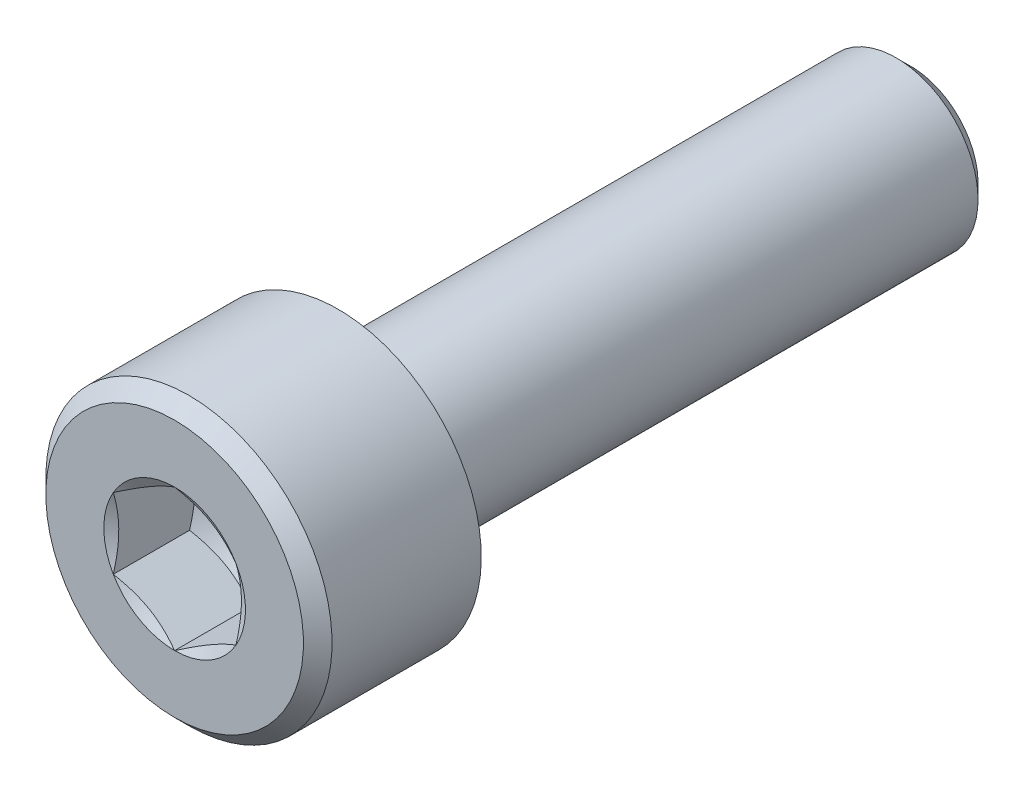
ISO-10303-21;
HEADER;
FILE_DESCRIPTION(('STEP AP214'),'2;1');
FILE_NAME('part.step','',(''),(''),'','','');
FILE_SCHEMA(('AUTOMOTIVE_DESIGN { 1 0 10303 214 1 1 1 1 }'));
ENDSEC;
DATA;
#1=APPLICATION_CONTEXT('core data for automotive mechanical design processes');
#2=APPLICATION_PROTOCOL_DEFINITION('international standard','automotive_design',2000,#1);
#3=PRODUCT_CONTEXT('',#1,'mechanical');
#4=PRODUCT('Part','Part','',(#3));
#5=PRODUCT_RELATED_PRODUCT_CATEGORY('part','',(#4));
#6=PRODUCT_DEFINITION_FORMATION('','',#4);
#7=PRODUCT_DEFINITION_CONTEXT('part definition',#1,'design');
#8=PRODUCT_DEFINITION('design','',#6,#7);
#9=PRODUCT_DEFINITION_SHAPE('','',#8);
#10=(LENGTH_UNIT() NAMED_UNIT(*) SI_UNIT(.MILLI.,.METRE.));
#11=(NAMED_UNIT(*) PLANE_ANGLE_UNIT() SI_UNIT($,.RADIAN.));
#12=(NAMED_UNIT(*) SI_UNIT($,.STERADIAN.) SOLID_ANGLE_UNIT());
#13=UNCERTAINTY_MEASURE_WITH_UNIT(LENGTH_MEASURE(1.E-05),#10,'distance_accuracy_value','');
#14=(GEOMETRIC_REPRESENTATION_CONTEXT(3) GLOBAL_UNCERTAINTY_ASSIGNED_CONTEXT((#13)) GLOBAL_UNIT_ASSIGNED_CONTEXT((#10,
#11,#12)) REPRESENTATION_CONTEXT('',''));
#15=CARTESIAN_POINT('',(0.,0.,0.));
#16=DIRECTION('',(0.,0.,1.));
#17=DIRECTION('',(1.,0.,0.));
#18=AXIS2_PLACEMENT_3D('',#15,#16,#17);
#19=CARTESIAN_POINT('',(0.,3.5,4.));
#20=DIRECTION('',(0.,0.,-1.));
#21=DIRECTION('',(0.,1.,0.));
#22=AXIS2_PLACEMENT_3D('',#19,#20,#21);
#23=PLANE('',#22);
#24=CARTESIAN_POINT('',(0.,0.,4.));
#25=DIRECTION('',(0.,0.,-1.));
#26=DIRECTION('',(0.,1.,0.));
#27=AXIS2_PLACEMENT_3D('',#24,#25,#26);
#28=CIRCLE('',#27,3.15);
#29=CARTESIAN_POINT('',(0.,3.15,4.));
#30=VERTEX_POINT('',#29);
#31=EDGE_CURVE('E299',#30,#30,#28,.F.);
#32=ORIENTED_EDGE('',*,*,#31,.T.);
#33=EDGE_LOOP('',(#32));
#34=FACE_BOUND('',#33,.T.);
#35=CARTESIAN_POINT('',(0.,0.,4.));
#36=DIRECTION('',(0.,0.,-1.));
#37=DIRECTION('',(0.,1.,0.));
#38=AXIS2_PLACEMENT_3D('',#35,#36,#37);
#39=CIRCLE('',#38,1.73205080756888);
#40=CARTESIAN_POINT('',(0.,1.73205080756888,4.));
#41=VERTEX_POINT('',#40);
#42=CARTESIAN_POINT('',(-1.5,0.866025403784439,4.));
#43=VERTEX_POINT('',#42);
#44=EDGE_CURVE('E111',#41,#43,#39,.F.);
#45=ORIENTED_EDGE('',*,*,#44,.F.);
#46=CARTESIAN_POINT('',(1.5,0.866025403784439,4.));
#47=VERTEX_POINT('',#46);
#48=EDGE_CURVE('E99',#47,#41,#39,.F.);
#49=ORIENTED_EDGE('',*,*,#48,.F.);
#50=CARTESIAN_POINT('',(1.5,-0.866025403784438,4.));
#51=VERTEX_POINT('',#50);
#52=EDGE_CURVE('E109',#51,#47,#39,.F.);
#53=ORIENTED_EDGE('',*,*,#52,.F.);
#54=CARTESIAN_POINT('',(0.,-1.73205080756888,4.));
#55=VERTEX_POINT('',#54);
#56=EDGE_CURVE('E463',#55,#51,#39,.F.);
#57=ORIENTED_EDGE('',*,*,#56,.F.);
#58=CARTESIAN_POINT('',(-1.5,-0.866025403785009,3.99999999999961));
#59=VERTEX_POINT('',#58);
#60=EDGE_CURVE('E146',#59,#55,#39,.F.);
#61=ORIENTED_EDGE('',*,*,#60,.F.);
#62=EDGE_CURVE('E141',#43,#59,#39,.F.);
#63=ORIENTED_EDGE('',*,*,#62,.F.);
#64=EDGE_LOOP('',(#45,#49,#53,#57,#61,#63));
#65=FACE_BOUND('',#64,.T.);
#66=ADVANCED_FACE('F42',(#34,#65),#23,.F.);
#67=CARTESIAN_POINT('',(0.,2.,0.));
#68=DIRECTION('',(0.,0.,1.));
#69=DIRECTION('',(0.,-1.,0.));
#70=AXIS2_PLACEMENT_3D('',#67,#68,#69);
#71=PLANE('',#70);
#72=CARTESIAN_POINT('',(0.,0.,0.));
#73=DIRECTION('',(0.,0.,1.));
#74=DIRECTION('',(0.,-1.,0.));
#75=AXIS2_PLACEMENT_3D('',#72,#73,#74);
#76=CIRCLE('',#75,2.4);
#77=CARTESIAN_POINT('',(0.,-2.4,0.));
#78=VERTEX_POINT('',#77);
#79=EDGE_CURVE('E51',#78,#78,#76,.T.);
#80=ORIENTED_EDGE('',*,*,#79,.T.);
#81=EDGE_LOOP('',(#80));
#82=FACE_BOUND('',#81,.T.);
#83=CARTESIAN_POINT('',(0.,0.,0.));
#84=DIRECTION('',(0.,0.,1.));
#85=DIRECTION('',(0.,-1.,0.));
#86=AXIS2_PLACEMENT_3D('',#83,#84,#85);
#87=CIRCLE('',#86,3.5);
#88=CARTESIAN_POINT('',(0.,-3.5,0.));
#89=VERTEX_POINT('',#88);
#90=EDGE_CURVE('E431',#89,#89,#87,.T.);
#91=ORIENTED_EDGE('',*,*,#90,.F.);
#92=EDGE_LOOP('',(#91));
#93=FACE_BOUND('',#92,.T.);
#94=ADVANCED_FACE('F260',(#82,#93),#71,.F.);
#95=CARTESIAN_POINT('',(0.,0.,4.));
#96=DIRECTION('',(0.,0.,1.));
#97=DIRECTION('',(0.,-1.,0.));
#98=AXIS2_PLACEMENT_3D('',#95,#96,#97);
#99=CYLINDRICAL_SURFACE('',#98,2.);
#100=CARTESIAN_POINT('',(0.,0.,-0.4));
#101=DIRECTION('',(0.,0.,1.));
#102=DIRECTION('',(0.,-1.,0.));
#103=AXIS2_PLACEMENT_3D('',#100,#101,#102);
#104=CIRCLE('',#103,2.);
#105=CARTESIAN_POINT('',(0.,-2.,-0.4));
#106=VERTEX_POINT('',#105);
#107=EDGE_CURVE('E12',#106,#106,#104,.F.);
#108=ORIENTED_EDGE('',*,*,#107,.T.);
#109=EDGE_LOOP('',(#108));
#110=FACE_BOUND('',#109,.T.);
#111=CARTESIAN_POINT('',(0.,0.,-13.65));
#112=DIRECTION('',(0.,0.,1.));
#113=DIRECTION('',(0.,-1.,0.));
#114=AXIS2_PLACEMENT_3D('',#111,#112,#113);
#115=CIRCLE('',#114,2.);
#116=CARTESIAN_POINT('',(0.,-2.,-13.65));
#117=VERTEX_POINT('',#116);
#118=EDGE_CURVE('E290',#117,#117,#115,.T.);
#119=ORIENTED_EDGE('',*,*,#118,.T.);
#120=EDGE_LOOP('',(#119));
#121=FACE_BOUND('',#120,.T.);
#122=ADVANCED_FACE('F264',(#110,#121),#99,.T.);
#123=CARTESIAN_POINT('',(0.,0.,-14.));
#124=DIRECTION('',(0.,0.,1.));
#125=DIRECTION('',(0.,-1.,0.));
#126=AXIS2_PLACEMENT_3D('',#123,#124,#125);
#127=PLANE('',#126);
#128=CARTESIAN_POINT('',(0.,0.,-14.));
#129=DIRECTION('',(0.,0.,1.));
#130=DIRECTION('',(0.,-1.,0.));
#131=AXIS2_PLACEMENT_3D('',#128,#129,#130);
#132=CIRCLE('',#131,1.65);
#133=CARTESIAN_POINT('',(0.,-1.65,-14.));
#134=VERTEX_POINT('',#133);
#135=EDGE_CURVE('E122',#134,#134,#132,.F.);
#136=ORIENTED_EDGE('',*,*,#135,.T.);
#137=EDGE_LOOP('',(#136));
#138=FACE_BOUND('',#137,.T.);
#139=ADVANCED_FACE('F269',(#138),#127,.F.);
#140=CARTESIAN_POINT('',(0.,0.,4.));
#141=DIRECTION('',(0.,0.,1.));
#142=DIRECTION('',(0.,-1.,0.));
#143=AXIS2_PLACEMENT_3D('',#140,#141,#142);
#144=CYLINDRICAL_SURFACE('',#143,3.5);
#145=CARTESIAN_POINT('',(0.,0.,3.65));
#146=DIRECTION('',(0.,0.,-1.));
#147=DIRECTION('',(0.,1.,0.));
#148=AXIS2_PLACEMENT_3D('',#145,#146,#147);
#149=CIRCLE('',#148,3.5);
#150=CARTESIAN_POINT('',(0.,3.5,3.65));
#151=VERTEX_POINT('',#150);
#152=EDGE_CURVE('E293',#151,#151,#149,.T.);
#153=ORIENTED_EDGE('',*,*,#152,.T.);
#154=EDGE_LOOP('',(#153));
#155=FACE_BOUND('',#154,.T.);
#156=ORIENTED_EDGE('',*,*,#90,.T.);
#157=EDGE_LOOP('',(#156));
#158=FACE_BOUND('',#157,.T.);
#159=ADVANCED_FACE('F181',(#155,#158),#144,.T.);
#160=CARTESIAN_POINT('',(0.,0.,4.));
#161=DIRECTION('',(0.,0.,-1.));
#162=DIRECTION('',(0.,1.,0.));
#163=AXIS2_PLACEMENT_3D('',#160,#161,#162);
#164=CONICAL_SURFACE('',#163,3.15,0.78539816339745);
#165=ORIENTED_EDGE('',*,*,#152,.F.);
#166=EDGE_LOOP('',(#165));
#167=FACE_BOUND('',#166,.T.);
#168=ORIENTED_EDGE('',*,*,#31,.F.);
#169=EDGE_LOOP('',(#168));
#170=FACE_BOUND('',#169,.T.);
#171=ADVANCED_FACE('F276',(#167,#170),#164,.T.);
#172=CARTESIAN_POINT('',(0.,0.,-13.65));
#173=DIRECTION('',(0.,0.,1.));
#174=DIRECTION('',(0.,-1.,0.));
#175=AXIS2_PLACEMENT_3D('',#172,#173,#174);
#176=CONICAL_SURFACE('',#175,2.,0.785398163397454);
#177=ORIENTED_EDGE('',*,*,#135,.F.);
#178=EDGE_LOOP('',(#177));
#179=FACE_BOUND('',#178,.T.);
#180=ORIENTED_EDGE('',*,*,#118,.F.);
#181=EDGE_LOOP('',(#180));
#182=FACE_BOUND('',#181,.T.);
#183=ADVANCED_FACE('F278',(#179,#182),#176,.T.);
#184=CARTESIAN_POINT('',(0.,0.,3.86602540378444));
#185=DIRECTION('',(0.,0.,1.));
#186=DIRECTION('',(0.,-1.,0.));
#187=AXIS2_PLACEMENT_3D('',#184,#185,#186);
#188=CONICAL_SURFACE('',#187,1.5,1.04719755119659);
#189=ORIENTED_EDGE('',*,*,#44,.T.);
#190=CARTESIAN_POINT('',(-1.5002,0.865909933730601,4.00006667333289));
#191=CARTESIAN_POINT('',(-1.43428070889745,0.903968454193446,3.97808285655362));
#192=CARTESIAN_POINT('',(-1.36779241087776,0.942355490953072,3.95808888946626));
#193=CARTESIAN_POINT('',(-1.23366433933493,1.01979436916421,3.92318810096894));
#194=CARTESIAN_POINT('',(-1.16602218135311,1.05884758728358,3.9082936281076));
#195=CARTESIAN_POINT('',(-1.03157622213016,1.13646999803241,3.88510668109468));
#196=CARTESIAN_POINT('',(-0.96479311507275,1.17502724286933,3.87665991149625));
#197=CARTESIAN_POINT('',(-0.830912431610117,1.25232329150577,3.86657357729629));
#198=CARTESIAN_POINT('',(-0.763815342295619,1.29106181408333,3.86492566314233));
#199=CARTESIAN_POINT('',(-0.638425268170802,1.363455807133,3.86834162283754));
#200=CARTESIAN_POINT('',(-0.580113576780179,1.39712207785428,3.87256675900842));
#201=CARTESIAN_POINT('',(-0.463870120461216,1.46423526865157,3.88596177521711));
#202=CARTESIAN_POINT('',(-0.405938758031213,1.49768195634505,3.89513623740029));
#203=CARTESIAN_POINT('',(-0.289455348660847,1.56493368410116,3.91807318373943));
#204=CARTESIAN_POINT('',(-0.230918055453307,1.59873020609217,3.93193296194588));
#205=CARTESIAN_POINT('',(-0.11471687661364,1.6658189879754,3.96338978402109));
#206=CARTESIAN_POINT('',(-0.0570515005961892,1.699112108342,3.98097942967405));
#207=CARTESIAN_POINT('',(0.000199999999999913,1.73216627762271,4.00006667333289));
#208=B_SPLINE_CURVE_WITH_KNOTS('',3,(#190,#191,#192,#193,#194,#195,#196,#197,#198,#199,#200,
#201,#202,#203,#204,#205,#206,#207),.UNSPECIFIED.,.F.,.F.,(4,2,2,2,2,2,2,2,4),(0.,
0.237777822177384,0.47612742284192,0.708577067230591,0.940741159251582,1.14294352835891,
1.34533342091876,1.55221450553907,1.75868901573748),.UNSPECIFIED.);
#209=EDGE_CURVE('E115',#43,#41,#208,.T.);
#210=ORIENTED_EDGE('',*,*,#209,.T.);
#211=EDGE_LOOP('',(#189,#210));
#212=FACE_BOUND('',#211,.T.);
#213=ADVANCED_FACE('F116',(#212),#188,.F.);
#214=ORIENTED_EDGE('',*,*,#62,.T.);
#215=CARTESIAN_POINT('',(-1.5,-2.29682699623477,4.58381546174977));
#216=CARTESIAN_POINT('',(-1.5,-2.2309684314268,4.55198894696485));
#217=CARTESIAN_POINT('',(-1.5,-2.16495427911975,4.52047890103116));
#218=CARTESIAN_POINT('',(-1.5,-2.03253035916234,4.45827236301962));
#219=CARTESIAN_POINT('',(-1.5,-1.96612052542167,4.42757601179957));
#220=CARTESIAN_POINT('',(-1.5,-1.83246206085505,4.36701576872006));
#221=CARTESIAN_POINT('',(-1.5,-1.76521080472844,4.33715764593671));
#222=CARTESIAN_POINT('',(-1.5,-1.63015654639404,4.27872457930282));
#223=CARTESIAN_POINT('',(-1.5,-1.56235357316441,4.25014956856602));
#224=CARTESIAN_POINT('',(-1.5,-1.42524182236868,4.19428123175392));
#225=CARTESIAN_POINT('',(-1.5,-1.35592477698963,4.1670079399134));
#226=CARTESIAN_POINT('',(-1.5,-1.21648682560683,4.114607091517));
#227=CARTESIAN_POINT('',(-1.5,-1.14636582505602,4.08947979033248));
#228=CARTESIAN_POINT('',(-1.5,-0.934888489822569,4.01830655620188));
#229=CARTESIAN_POINT('',(-1.5,-0.792055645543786,3.97631519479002));
#230=CARTESIAN_POINT('',(-1.5,-0.574716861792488,3.92662686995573));
#231=CARTESIAN_POINT('',(-1.5,-0.501740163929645,3.91227894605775));
#232=CARTESIAN_POINT('',(-1.5,-0.35490257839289,3.88900178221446));
#233=CARTESIAN_POINT('',(-1.5,-0.281041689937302,3.88007254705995));
#234=CARTESIAN_POINT('',(-1.5,-0.133293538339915,3.86841949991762));
#235=CARTESIAN_POINT('',(-1.5,-0.0594094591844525,3.86565640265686));
#236=CARTESIAN_POINT('',(-1.5,0.0882997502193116,3.86647471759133));
#237=CARTESIAN_POINT('',(-1.5,0.16212489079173,3.87005448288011));
#238=CARTESIAN_POINT('',(-1.5,0.340722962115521,3.88606868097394));
#239=CARTESIAN_POINT('',(-1.5,0.445215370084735,3.9016376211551));
#240=CARTESIAN_POINT('',(-1.5,0.652266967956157,3.94267501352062));
#241=CARTESIAN_POINT('',(-1.5,0.75482373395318,3.96815511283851));
#242=CARTESIAN_POINT('',(-1.5,0.908315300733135,4.0120946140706));
#243=CARTESIAN_POINT('',(-1.5,0.960034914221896,4.02791828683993));
#244=CARTESIAN_POINT('',(-1.5,1.06293144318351,4.0611319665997));
#245=CARTESIAN_POINT('',(-1.5,1.11410870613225,4.07852089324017));
#246=CARTESIAN_POINT('',(-1.5,1.21571016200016,4.11450258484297));
#247=CARTESIAN_POINT('',(-1.5,1.26613697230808,4.13308802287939));
#248=CARTESIAN_POINT('',(-1.5,1.36659934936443,4.17134976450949));
#249=CARTESIAN_POINT('',(-1.5,1.41663474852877,4.19102650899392));
#250=CARTESIAN_POINT('',(-1.5,1.46648887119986,4.21114128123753));
#251=B_SPLINE_CURVE_WITH_KNOTS('',3,(#215,#216,#217,#218,#219,#220,#221,#222,#223,#224,#225,
#226,#227,#228,#229,#230,#231,#232,#233,#234,#235,#236,#237,#238,#239,#240,#241,#242,#243,#244,
#245,#246,#247,#248,#249,#250),.UNSPECIFIED.,.F.,.F.,(4,2,2,2,2,2,2,2,2,2,2,2,2,2,2,2,2,4),(0.,
0.219439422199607,0.438916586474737,0.659649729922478,0.880371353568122,1.10380188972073,
1.32725897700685,1.77299403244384,1.99595442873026,2.21891502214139,2.44045099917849,
2.66192946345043,2.97821851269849,3.29488037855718,3.45711959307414,3.6192476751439,
3.78046319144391,3.94174432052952),.UNSPECIFIED.);
#252=EDGE_CURVE('E243',#59,#43,#251,.T.);
#253=ORIENTED_EDGE('',*,*,#252,.T.);
#254=EDGE_LOOP('',(#214,#253));
#255=FACE_BOUND('',#254,.T.);
#256=ADVANCED_FACE('F284',(#255),#188,.F.);
#257=ORIENTED_EDGE('',*,*,#60,.T.);
#258=CARTESIAN_POINT('',(0.000200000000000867,-1.73216627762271,4.00006667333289));
#259=CARTESIAN_POINT('',(-0.0657192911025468,-1.69410775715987,3.97808285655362));
#260=CARTESIAN_POINT('',(-0.132207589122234,-1.65572072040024,3.95808888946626));
#261=CARTESIAN_POINT('',(-0.266335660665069,-1.5782818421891,3.92318810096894));
#262=CARTESIAN_POINT('',(-0.333977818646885,-1.53922862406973,3.9082936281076));
#263=CARTESIAN_POINT('',(-0.468423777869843,-1.4616062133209,3.88510668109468));
#264=CARTESIAN_POINT('',(-0.535206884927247,-1.42304896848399,3.87665991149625));
#265=CARTESIAN_POINT('',(-0.66908756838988,-1.34575291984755,3.86657357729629));
#266=CARTESIAN_POINT('',(-0.736184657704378,-1.30701439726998,3.86492566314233));
#267=CARTESIAN_POINT('',(-0.861574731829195,-1.23462040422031,3.86834162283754));
#268=CARTESIAN_POINT('',(-0.919886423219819,-1.20095413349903,3.87256675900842));
#269=CARTESIAN_POINT('',(-1.03612987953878,-1.13384094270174,3.88596177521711));
#270=CARTESIAN_POINT('',(-1.09406124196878,-1.10039425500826,3.89513623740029));
#271=CARTESIAN_POINT('',(-1.21054465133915,-1.03314252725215,3.91807318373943));
#272=CARTESIAN_POINT('',(-1.26908194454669,-0.99934600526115,3.93193296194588));
#273=CARTESIAN_POINT('',(-1.38528312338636,-0.932257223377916,3.96338978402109));
#274=CARTESIAN_POINT('',(-1.44294849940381,-0.89896410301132,3.98097942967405));
#275=CARTESIAN_POINT('',(-1.5002,-0.8659099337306,4.00006667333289));
#276=B_SPLINE_CURVE_WITH_KNOTS('',3,(#258,#259,#260,#261,#262,#263,#264,#265,#266,#267,#268,
#269,#270,#271,#272,#273,#274,#275),.UNSPECIFIED.,.F.,.F.,(4,2,2,2,2,2,2,2,4),(0.,
0.237777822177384,0.47612742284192,0.708577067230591,0.940741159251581,1.14294352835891,
1.34533342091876,1.55221450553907,1.75868901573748),.UNSPECIFIED.);
#277=EDGE_CURVE('E236',#55,#59,#276,.T.);
#278=ORIENTED_EDGE('',*,*,#277,.T.);
#279=EDGE_LOOP('',(#257,#278));
#280=FACE_BOUND('',#279,.T.);
#281=ADVANCED_FACE('F377',(#280),#188,.F.);
#282=ORIENTED_EDGE('',*,*,#56,.T.);
#283=CARTESIAN_POINT('',(1.5002,-0.8659099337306,4.00006667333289));
#284=CARTESIAN_POINT('',(1.43428070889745,-0.903968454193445,3.97808285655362));
#285=CARTESIAN_POINT('',(1.36779241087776,-0.942355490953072,3.95808888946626));
#286=CARTESIAN_POINT('',(1.23366433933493,-1.01979436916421,3.92318810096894));
#287=CARTESIAN_POINT('',(1.16602218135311,-1.05884758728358,3.9082936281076));
#288=CARTESIAN_POINT('',(1.03157622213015,-1.13646999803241,3.88510668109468));
#289=CARTESIAN_POINT('',(0.96479311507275,-1.17502724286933,3.87665991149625));
#290=CARTESIAN_POINT('',(0.830912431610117,-1.25232329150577,3.86657357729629));
#291=CARTESIAN_POINT('',(0.763815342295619,-1.29106181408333,3.86492566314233));
#292=CARTESIAN_POINT('',(0.638425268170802,-1.363455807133,3.86834162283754));
#293=CARTESIAN_POINT('',(0.580113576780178,-1.39712207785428,3.87256675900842));
#294=CARTESIAN_POINT('',(0.463870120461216,-1.46423526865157,3.88596177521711));
#295=CARTESIAN_POINT('',(0.405938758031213,-1.49768195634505,3.89513623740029));
#296=CARTESIAN_POINT('',(0.289455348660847,-1.56493368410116,3.91807318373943));
#297=CARTESIAN_POINT('',(0.230918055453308,-1.59873020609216,3.93193296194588));
#298=CARTESIAN_POINT('',(0.11471687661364,-1.6658189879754,3.96338978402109));
#299=CARTESIAN_POINT('',(0.0570515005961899,-1.69911210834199,3.98097942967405));
#300=CARTESIAN_POINT('',(-0.000199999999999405,-1.73216627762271,4.00006667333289));
#301=B_SPLINE_CURVE_WITH_KNOTS('',3,(#283,#284,#285,#286,#287,#288,#289,#290,#291,#292,#293,
#294,#295,#296,#297,#298,#299,#300),.UNSPECIFIED.,.F.,.F.,(4,2,2,2,2,2,2,2,4),(0.,
0.237777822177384,0.476127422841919,0.70857706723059,0.940741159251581,1.1429435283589,
1.34533342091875,1.55221450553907,1.75868901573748),.UNSPECIFIED.);
#302=EDGE_CURVE('E63',#51,#55,#301,.T.);
#303=ORIENTED_EDGE('',*,*,#302,.T.);
#304=EDGE_LOOP('',(#282,#303));
#305=FACE_BOUND('',#304,.T.);
#306=ADVANCED_FACE('F370',(#305),#188,.F.);
#307=ORIENTED_EDGE('',*,*,#52,.T.);
#308=CARTESIAN_POINT('',(1.5,-2.29682699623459,4.58381546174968));
#309=CARTESIAN_POINT('',(1.5,-2.23096843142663,4.55198894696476));
#310=CARTESIAN_POINT('',(1.5,-2.16495427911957,4.52047890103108));
#311=CARTESIAN_POINT('',(1.5,-2.03253035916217,4.45827236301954));
#312=CARTESIAN_POINT('',(1.5,-1.9661205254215,4.42757601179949));
#313=CARTESIAN_POINT('',(1.5,-1.83246206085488,4.36701576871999));
#314=CARTESIAN_POINT('',(1.5,-1.76521080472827,4.33715764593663));
#315=CARTESIAN_POINT('',(1.5,-1.63015654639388,4.27872457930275));
#316=CARTESIAN_POINT('',(1.5,-1.56235357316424,4.25014956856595));
#317=CARTESIAN_POINT('',(1.5,-1.42524182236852,4.19428123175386));
#318=CARTESIAN_POINT('',(1.5,-1.35592477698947,4.16700793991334));
#319=CARTESIAN_POINT('',(1.5,-1.21648682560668,4.11460709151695));
#320=CARTESIAN_POINT('',(1.5,-1.14636582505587,4.08947979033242));
#321=CARTESIAN_POINT('',(1.5,-0.934888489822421,4.01830655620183));
#322=CARTESIAN_POINT('',(1.5,-0.792055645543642,3.97631519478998));
#323=CARTESIAN_POINT('',(1.5,-0.57471686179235,3.9266268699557));
#324=CARTESIAN_POINT('',(1.5,-0.501740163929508,3.91227894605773));
#325=CARTESIAN_POINT('',(1.5,-0.354902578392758,3.88900178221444));
#326=CARTESIAN_POINT('',(1.5,-0.281041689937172,3.88007254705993));
#327=CARTESIAN_POINT('',(1.5,-0.133293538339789,3.86841949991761));
#328=CARTESIAN_POINT('',(1.5,-0.0594094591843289,3.86565640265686));
#329=CARTESIAN_POINT('',(1.5,0.0882997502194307,3.86647471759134));
#330=CARTESIAN_POINT('',(1.5,0.162124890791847,3.87005448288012));
#331=CARTESIAN_POINT('',(1.5,0.340722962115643,3.88606868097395));
#332=CARTESIAN_POINT('',(1.5,0.445215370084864,3.90163762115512));
#333=CARTESIAN_POINT('',(1.5,0.6522669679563,3.94267501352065));
#334=CARTESIAN_POINT('',(1.5,0.75482373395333,3.96815511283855));
#335=CARTESIAN_POINT('',(1.5,0.908315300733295,4.01209461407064));
#336=CARTESIAN_POINT('',(1.5,0.96003491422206,4.02791828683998));
#337=CARTESIAN_POINT('',(1.5,1.06293144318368,4.06113196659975));
#338=CARTESIAN_POINT('',(1.5,1.11410870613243,4.07852089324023));
#339=CARTESIAN_POINT('',(1.5,1.21571016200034,4.11450258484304));
#340=CARTESIAN_POINT('',(1.5,1.26613697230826,4.13308802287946));
#341=CARTESIAN_POINT('',(1.5,1.36659934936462,4.17134976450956));
#342=CARTESIAN_POINT('',(1.5,1.41663474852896,4.19102650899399));
#343=CARTESIAN_POINT('',(1.5,1.46648887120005,4.21114128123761));
#344=B_SPLINE_CURVE_WITH_KNOTS('',3,(#308,#309,#310,#311,#312,#313,#314,#315,#316,#317,#318,
#319,#320,#321,#322,#323,#324,#325,#326,#327,#328,#329,#330,#331,#332,#333,#334,#335,#336,#337,
#338,#339,#340,#341,#342,#343),.UNSPECIFIED.,.F.,.F.,(4,2,2,2,2,2,2,2,2,2,2,2,2,2,2,2,2,4),(0.,
0.219439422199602,0.438916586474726,0.659649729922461,0.8803713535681,1.1038018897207,
1.32725897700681,1.77299403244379,1.99595442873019,2.21891502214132,2.44045099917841,
2.66192946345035,2.97821851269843,3.29488037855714,3.45711959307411,3.61924767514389,
3.78046319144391,3.94174432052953),.UNSPECIFIED.);
#345=EDGE_CURVE('E57',#47,#51,#344,.F.);
#346=ORIENTED_EDGE('',*,*,#345,.T.);
#347=EDGE_LOOP('',(#307,#346));
#348=FACE_BOUND('',#347,.T.);
#349=ADVANCED_FACE('F363',(#348),#188,.F.);
#350=ORIENTED_EDGE('',*,*,#48,.T.);
#351=CARTESIAN_POINT('',(-0.000200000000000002,1.73216627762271,4.00006667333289));
#352=CARTESIAN_POINT('',(0.0657192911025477,1.69410775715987,3.97808285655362));
#353=CARTESIAN_POINT('',(0.132207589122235,1.65572072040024,3.95808888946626));
#354=CARTESIAN_POINT('',(0.266335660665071,1.5782818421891,3.92318810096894));
#355=CARTESIAN_POINT('',(0.333977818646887,1.53922862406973,3.9082936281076));
#356=CARTESIAN_POINT('',(0.468423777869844,1.4616062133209,3.88510668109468));
#357=CARTESIAN_POINT('',(0.535206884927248,1.42304896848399,3.87665991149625));
#358=CARTESIAN_POINT('',(0.669087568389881,1.34575291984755,3.86657357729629));
#359=CARTESIAN_POINT('',(0.736184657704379,1.30701439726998,3.86492566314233));
#360=CARTESIAN_POINT('',(0.861574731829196,1.23462040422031,3.86834162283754));
#361=CARTESIAN_POINT('',(0.91988642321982,1.20095413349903,3.87256675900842));
#362=CARTESIAN_POINT('',(1.03612987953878,1.13384094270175,3.88596177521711));
#363=CARTESIAN_POINT('',(1.09406124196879,1.10039425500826,3.89513623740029));
#364=CARTESIAN_POINT('',(1.21054465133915,1.03314252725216,3.91807318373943));
#365=CARTESIAN_POINT('',(1.26908194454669,0.999346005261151,3.93193296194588));
#366=CARTESIAN_POINT('',(1.38528312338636,0.932257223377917,3.96338978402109));
#367=CARTESIAN_POINT('',(1.44294849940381,0.898964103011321,3.98097942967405));
#368=CARTESIAN_POINT('',(1.5002,0.865909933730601,4.00006667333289));
#369=B_SPLINE_CURVE_WITH_KNOTS('',3,(#351,#352,#353,#354,#355,#356,#357,#358,#359,#360,#361,
#362,#363,#364,#365,#366,#367,#368),.UNSPECIFIED.,.F.,.F.,(4,2,2,2,2,2,2,2,4),(0.,
0.237777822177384,0.47612742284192,0.708577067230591,0.940741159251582,1.14294352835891,
1.34533342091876,1.55221450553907,1.75868901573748),.UNSPECIFIED.);
#370=EDGE_CURVE('E103',#41,#47,#369,.T.);
#371=ORIENTED_EDGE('',*,*,#370,.T.);
#372=EDGE_LOOP('',(#350,#371));
#373=FACE_BOUND('',#372,.T.);
#374=ADVANCED_FACE('F101',(#373),#188,.F.);
#375=CARTESIAN_POINT('',(0.,0.,1.13397459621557));
#376=DIRECTION('',(0.,0.,1.));
#377=DIRECTION('',(1.,0.,0.));
#378=AXIS2_PLACEMENT_3D('',#375,#376,#377);
#379=CONICAL_SURFACE('',#378,0.,1.0471975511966);
#380=CARTESIAN_POINT('',(1.5002,-0.8659099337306,2.13404126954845));
#381=CARTESIAN_POINT('',(1.43428070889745,-0.903968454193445,2.11205745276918));
#382=CARTESIAN_POINT('',(1.36779241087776,-0.942355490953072,2.09206348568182));
#383=CARTESIAN_POINT('',(1.23366433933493,-1.01979436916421,2.05716269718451));
#384=CARTESIAN_POINT('',(1.16602218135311,-1.05884758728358,2.04226822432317));
#385=CARTESIAN_POINT('',(1.03157622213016,-1.13646999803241,2.01908127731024));
#386=CARTESIAN_POINT('',(0.964793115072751,-1.17502724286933,2.01063450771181));
#387=CARTESIAN_POINT('',(0.830912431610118,-1.25232329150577,2.00054817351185));
#388=CARTESIAN_POINT('',(0.76381534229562,-1.29106181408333,1.99890025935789));
#389=CARTESIAN_POINT('',(0.638425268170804,-1.363455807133,2.0023162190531));
#390=CARTESIAN_POINT('',(0.58011357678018,-1.39712207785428,2.00654135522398));
#391=CARTESIAN_POINT('',(0.463870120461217,-1.46423526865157,2.01993637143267));
#392=CARTESIAN_POINT('',(0.405938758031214,-1.49768195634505,2.02911083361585));
#393=CARTESIAN_POINT('',(0.289455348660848,-1.56493368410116,2.05204777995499));
#394=CARTESIAN_POINT('',(0.230918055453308,-1.59873020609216,2.06590755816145));
#395=CARTESIAN_POINT('',(0.114716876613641,-1.6658189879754,2.09736438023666));
#396=CARTESIAN_POINT('',(0.0570515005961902,-1.69911210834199,2.11495402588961));
#397=CARTESIAN_POINT('',(-0.000199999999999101,-1.73216627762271,2.13404126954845));
#398=B_SPLINE_CURVE_WITH_KNOTS('',3,(#380,#381,#382,#383,#384,#385,#386,#387,#388,#389,#390,
#391,#392,#393,#394,#395,#396,#397),.UNSPECIFIED.,.F.,.F.,(4,2,2,2,2,2,2,2,4),(0.,
0.237777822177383,0.476127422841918,0.708577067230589,0.940741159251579,1.1429435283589,
1.34533342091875,1.55221450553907,1.75868901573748),.UNSPECIFIED.);
#399=CARTESIAN_POINT('',(1.5,-0.866025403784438,2.13397459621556));
#400=VERTEX_POINT('',#399);
#401=CARTESIAN_POINT('',(0.,-1.73205080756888,2.13397459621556));
#402=VERTEX_POINT('',#401);
#403=EDGE_CURVE('E195',#400,#402,#398,.T.);
#404=ORIENTED_EDGE('',*,*,#403,.F.);
#405=CARTESIAN_POINT('',(1.5,-2.33638172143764,2.73695926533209));
#406=CARTESIAN_POINT('',(1.5,-2.27073746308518,2.7050753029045));
#407=CARTESIAN_POINT('',(1.5,-2.20494350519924,2.67349431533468));
#408=CARTESIAN_POINT('',(1.5,-2.07297652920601,2.61110864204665));
#409=CARTESIAN_POINT('',(1.5,-2.00680345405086,2.5803040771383));
#410=CARTESIAN_POINT('',(1.5,-1.87366303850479,2.51948904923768));
#411=CARTESIAN_POINT('',(1.5,-1.80669334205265,2.48948372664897));
#412=CARTESIAN_POINT('',(1.5,-1.67222431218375,2.43068893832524));
#413=CARTESIAN_POINT('',(1.5,-1.60472500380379,2.40189941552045));
#414=CARTESIAN_POINT('',(1.5,-1.46696329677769,2.34497876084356));
#415=CARTESIAN_POINT('',(1.5,-1.39668058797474,2.31689651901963));
#416=CARTESIAN_POINT('',(1.5,-1.25529643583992,2.26283280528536));
#417=CARTESIAN_POINT('',(1.5,-1.1841948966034,2.23685158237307));
#418=CARTESIAN_POINT('',(1.5,-1.04119289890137,2.18766516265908));
#419=CARTESIAN_POINT('',(1.5,-0.969294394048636,2.16445434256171));
#420=CARTESIAN_POINT('',(1.5,-0.824460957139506,2.12154326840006));
#421=CARTESIAN_POINT('',(1.5,-0.751526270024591,2.10184219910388));
#422=CARTESIAN_POINT('',(1.5,-0.604949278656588,2.06698624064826));
#423=CARTESIAN_POINT('',(1.5,-0.531312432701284,2.05180882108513));
#424=CARTESIAN_POINT('',(1.5,-0.383114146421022,2.0268654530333));
#425=CARTESIAN_POINT('',(1.5,-0.308552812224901,2.0170988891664));
#426=CARTESIAN_POINT('',(1.5,-0.159849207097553,2.00388569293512));
#427=CARTESIAN_POINT('',(1.5,-0.0857144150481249,2.00035726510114));
#428=CARTESIAN_POINT('',(1.5,0.0625848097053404,1.9996942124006));
#429=CARTESIAN_POINT('',(1.5,0.136749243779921,2.00255992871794));
#430=CARTESIAN_POINT('',(1.5,0.313926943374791,2.0167964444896));
#431=CARTESIAN_POINT('',(1.5,0.416706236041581,2.03109167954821));
#432=CARTESIAN_POINT('',(1.5,0.6204409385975,2.06949441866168));
#433=CARTESIAN_POINT('',(1.5,0.721394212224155,2.09361272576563));
#434=CARTESIAN_POINT('',(1.5,0.872531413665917,2.13552332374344));
#435=CARTESIAN_POINT('',(1.5,0.923479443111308,2.15066992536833));
#436=CARTESIAN_POINT('',(1.5,1.0248466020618,2.18254554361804));
#437=CARTESIAN_POINT('',(1.5,1.07526602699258,2.1992736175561));
#438=CARTESIAN_POINT('',(1.5,1.17563999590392,2.234052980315));
#439=CARTESIAN_POINT('',(1.5,1.22559456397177,2.25210420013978));
#440=CARTESIAN_POINT('',(1.5,1.32509493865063,2.28931641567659));
#441=CARTESIAN_POINT('',(1.5,1.37464068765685,2.30847756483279));
#442=CARTESIAN_POINT('',(1.5,1.54079899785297,2.37451828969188));
#443=CARTESIAN_POINT('',(1.5,1.65657296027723,2.42350677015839));
#444=CARTESIAN_POINT('',(1.5,1.88662968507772,2.52488299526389));
#445=CARTESIAN_POINT('',(1.5,2.00091210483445,2.57727150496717));
#446=CARTESIAN_POINT('',(1.5,2.22843594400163,2.68441475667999));
#447=CARTESIAN_POINT('',(1.5,2.34167674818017,2.73917080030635));
#448=CARTESIAN_POINT('',(1.5,2.56734049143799,2.85034680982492));
#449=CARTESIAN_POINT('',(1.5,2.6797633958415,2.9067668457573));
#450=CARTESIAN_POINT('',(1.5,3.01663743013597,3.07808122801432));
#451=CARTESIAN_POINT('',(1.5,3.24017029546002,3.19477748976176));
#452=CARTESIAN_POINT('',(1.5,3.68570645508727,3.43083807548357));
#453=CARTESIAN_POINT('',(1.5,3.9077102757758,3.55020141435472));
#454=CARTESIAN_POINT('',(1.5,4.31835016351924,3.77304008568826));
#455=CARTESIAN_POINT('',(1.5,4.50711258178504,3.87628281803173));
#456=CARTESIAN_POINT('',(1.5,4.88417484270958,4.08365722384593));
#457=CARTESIAN_POINT('',(1.5,5.07247463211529,4.18778899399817));
#458=CARTESIAN_POINT('',(1.5,5.44792415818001,4.39624523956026));
#459=CARTESIAN_POINT('',(1.5,5.63507538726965,4.50056702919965));
#460=CARTESIAN_POINT('',(1.5,6.00908589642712,4.70967986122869));
#461=CARTESIAN_POINT('',(1.5,6.19594520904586,4.81447084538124));
#462=CARTESIAN_POINT('',(1.5,6.38271019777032,4.9194287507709));
#463=B_SPLINE_CURVE_WITH_KNOTS('',3,(#405,#406,#407,#408,#409,#410,#411,#412,#413,#414,#415,
#416,#417,#418,#419,#420,#421,#422,#423,#424,#425,#426,#427,#428,#429,#430,#431,#432,#433,#434,
#435,#436,#437,#438,#439,#440,#441,#442,#443,#444,#445,#446,#447,#448,#449,#450,#451,#452,#453,
#454,#455,#456,#457,#458,#459,#460,#461,#462),.UNSPECIFIED.,.F.,.F.,(4,2,2,2,2,2,2,2,2,2,2,2,2,
2,2,2,2,2,2,2,2,2,2,2,2,2,2,2,4),(0.,0.218935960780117,0.437905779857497,0.658049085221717,
0.878182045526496,1.10521210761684,1.33226903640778,1.55885695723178,1.78539217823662,
2.01077950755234,2.23614119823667,2.45852535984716,2.68092138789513,2.9915936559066,
3.30260851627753,3.4620442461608,3.62138553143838,3.78071851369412,3.94007357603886,
4.3171115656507,4.69423469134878,5.07156785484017,5.44891692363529,6.20535831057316,
6.96152477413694,7.6069767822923,8.25249989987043,8.89528800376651,9.53799842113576),.UNSPECIFIED.);
#464=CARTESIAN_POINT('',(1.5,0.866025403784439,2.13397459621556));
#465=VERTEX_POINT('',#464);
#466=EDGE_CURVE('E202',#465,#400,#463,.F.);
#467=ORIENTED_EDGE('',*,*,#466,.F.);
#468=CARTESIAN_POINT('',(-0.000200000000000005,1.73216627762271,2.13404126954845));
#469=CARTESIAN_POINT('',(0.0657192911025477,1.69410775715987,2.11205745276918));
#470=CARTESIAN_POINT('',(0.132207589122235,1.65572072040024,2.09206348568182));
#471=CARTESIAN_POINT('',(0.26633566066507,1.5782818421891,2.05716269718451));
#472=CARTESIAN_POINT('',(0.333977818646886,1.53922862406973,2.04226822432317));
#473=CARTESIAN_POINT('',(0.468423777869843,1.4616062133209,2.01908127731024));
#474=CARTESIAN_POINT('',(0.535206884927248,1.42304896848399,2.01063450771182));
#475=CARTESIAN_POINT('',(0.66908756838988,1.34575291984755,2.00054817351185));
#476=CARTESIAN_POINT('',(0.736184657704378,1.30701439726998,1.99890025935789));
#477=CARTESIAN_POINT('',(0.861574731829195,1.23462040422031,2.0023162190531));
#478=CARTESIAN_POINT('',(0.919886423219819,1.20095413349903,2.00654135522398));
#479=CARTESIAN_POINT('',(1.03612987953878,1.13384094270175,2.01993637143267));
#480=CARTESIAN_POINT('',(1.09406124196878,1.10039425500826,2.02911083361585));
#481=CARTESIAN_POINT('',(1.21054465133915,1.03314252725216,2.05204777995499));
#482=CARTESIAN_POINT('',(1.26908194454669,0.999346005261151,2.06590755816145));
#483=CARTESIAN_POINT('',(1.38528312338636,0.932257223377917,2.09736438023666));
#484=CARTESIAN_POINT('',(1.44294849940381,0.898964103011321,2.11495402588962));
#485=CARTESIAN_POINT('',(1.5002,0.865909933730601,2.13404126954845));
#486=B_SPLINE_CURVE_WITH_KNOTS('',3,(#468,#469,#470,#471,#472,#473,#474,#475,#476,#477,#478,
#479,#480,#481,#482,#483,#484,#485),.UNSPECIFIED.,.F.,.F.,(4,2,2,2,2,2,2,2,4),(0.,
0.237777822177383,0.476127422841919,0.70857706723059,0.94074115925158,1.1429435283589,
1.34533342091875,1.55221450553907,1.75868901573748),.UNSPECIFIED.);
#487=CARTESIAN_POINT('',(0.,1.73205080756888,2.13397459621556));
#488=VERTEX_POINT('',#487);
#489=EDGE_CURVE('E210',#488,#465,#486,.T.);
#490=ORIENTED_EDGE('',*,*,#489,.F.);
#491=CARTESIAN_POINT('',(-1.5002,0.865909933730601,2.13404126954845));
#492=CARTESIAN_POINT('',(-1.43428070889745,0.903968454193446,2.11205745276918));
#493=CARTESIAN_POINT('',(-1.36779241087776,0.942355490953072,2.09206348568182));
#494=CARTESIAN_POINT('',(-1.23366433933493,1.01979436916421,2.05716269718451));
#495=CARTESIAN_POINT('',(-1.16602218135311,1.05884758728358,2.04226822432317));
#496=CARTESIAN_POINT('',(-1.03157622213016,1.13646999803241,2.01908127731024));
#497=CARTESIAN_POINT('',(-0.964793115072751,1.17502724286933,2.01063450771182));
#498=CARTESIAN_POINT('',(-0.830912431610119,1.25232329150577,2.00054817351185));
#499=CARTESIAN_POINT('',(-0.763815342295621,1.29106181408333,1.99890025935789));
#500=CARTESIAN_POINT('',(-0.638425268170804,1.363455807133,2.0023162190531));
#501=CARTESIAN_POINT('',(-0.58011357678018,1.39712207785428,2.00654135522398));
#502=CARTESIAN_POINT('',(-0.463870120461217,1.46423526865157,2.01993637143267));
#503=CARTESIAN_POINT('',(-0.405938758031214,1.49768195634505,2.02911083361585));
#504=CARTESIAN_POINT('',(-0.289455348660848,1.56493368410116,2.052047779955));
#505=CARTESIAN_POINT('',(-0.230918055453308,1.59873020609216,2.06590755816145));
#506=CARTESIAN_POINT('',(-0.11471687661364,1.6658189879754,2.09736438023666));
#507=CARTESIAN_POINT('',(-0.0570515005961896,1.69911210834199,2.11495402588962));
#508=CARTESIAN_POINT('',(0.000199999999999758,1.73216627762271,2.13404126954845));
#509=B_SPLINE_CURVE_WITH_KNOTS('',3,(#491,#492,#493,#494,#495,#496,#497,#498,#499,#500,#501,
#502,#503,#504,#505,#506,#507,#508),.UNSPECIFIED.,.F.,.F.,(4,2,2,2,2,2,2,2,4),(0.,
0.237777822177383,0.476127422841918,0.708577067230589,0.94074115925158,1.1429435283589,
1.34533342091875,1.55221450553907,1.75868901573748),.UNSPECIFIED.);
#510=CARTESIAN_POINT('',(-1.5,0.866025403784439,2.13397459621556));
#511=VERTEX_POINT('',#510);
#512=EDGE_CURVE('E134',#511,#488,#509,.T.);
#513=ORIENTED_EDGE('',*,*,#512,.F.);
#514=CARTESIAN_POINT('',(-1.5,-2.33638172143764,2.73695926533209));
#515=CARTESIAN_POINT('',(-1.5,-2.27073746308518,2.7050753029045));
#516=CARTESIAN_POINT('',(-1.5,-2.20494350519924,2.67349431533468));
#517=CARTESIAN_POINT('',(-1.5,-2.07297652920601,2.61110864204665));
#518=CARTESIAN_POINT('',(-1.5,-2.00680345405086,2.5803040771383));
#519=CARTESIAN_POINT('',(-1.5,-1.87366303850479,2.51948904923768));
#520=CARTESIAN_POINT('',(-1.5,-1.80669334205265,2.48948372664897));
#521=CARTESIAN_POINT('',(-1.5,-1.67222431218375,2.43068893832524));
#522=CARTESIAN_POINT('',(-1.5,-1.60472500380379,2.40189941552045));
#523=CARTESIAN_POINT('',(-1.5,-1.46696329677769,2.34497876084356));
#524=CARTESIAN_POINT('',(-1.5,-1.39668058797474,2.31689651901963));
#525=CARTESIAN_POINT('',(-1.5,-1.25529643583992,2.26283280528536));
#526=CARTESIAN_POINT('',(-1.5,-1.1841948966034,2.23685158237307));
#527=CARTESIAN_POINT('',(-1.5,-1.04119289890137,2.18766516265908));
#528=CARTESIAN_POINT('',(-1.5,-0.969294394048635,2.16445434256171));
#529=CARTESIAN_POINT('',(-1.5,-0.824460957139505,2.12154326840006));
#530=CARTESIAN_POINT('',(-1.5,-0.75152627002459,2.10184219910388));
#531=CARTESIAN_POINT('',(-1.5,-0.604949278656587,2.06698624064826));
#532=CARTESIAN_POINT('',(-1.5,-0.531312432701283,2.05180882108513));
#533=CARTESIAN_POINT('',(-1.5,-0.383114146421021,2.0268654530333));
#534=CARTESIAN_POINT('',(-1.5,-0.3085528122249,2.0170988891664));
#535=CARTESIAN_POINT('',(-1.5,-0.159849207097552,2.00388569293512));
#536=CARTESIAN_POINT('',(-1.5,-0.0857144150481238,2.00035726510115));
#537=CARTESIAN_POINT('',(-1.5,0.0625848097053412,1.99969421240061));
#538=CARTESIAN_POINT('',(-1.5,0.136749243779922,2.00255992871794));
#539=CARTESIAN_POINT('',(-1.5,0.313926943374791,2.0167964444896));
#540=CARTESIAN_POINT('',(-1.5,0.416706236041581,2.03109167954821));
#541=CARTESIAN_POINT('',(-1.5,0.6204409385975,2.06949441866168));
#542=CARTESIAN_POINT('',(-1.5,0.721394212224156,2.09361272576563));
#543=CARTESIAN_POINT('',(-1.5,0.872531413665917,2.13552332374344));
#544=CARTESIAN_POINT('',(-1.5,0.923479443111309,2.15066992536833));
#545=CARTESIAN_POINT('',(-1.5,1.0248466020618,2.18254554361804));
#546=CARTESIAN_POINT('',(-1.5,1.07526602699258,2.1992736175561));
#547=CARTESIAN_POINT('',(-1.5,1.17563999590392,2.234052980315));
#548=CARTESIAN_POINT('',(-1.5,1.22559456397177,2.25210420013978));
#549=CARTESIAN_POINT('',(-1.5,1.32509493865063,2.2893164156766));
#550=CARTESIAN_POINT('',(-1.5,1.37464068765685,2.30847756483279));
#551=CARTESIAN_POINT('',(-1.5,1.54079899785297,2.37451828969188));
#552=CARTESIAN_POINT('',(-1.5,1.65657296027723,2.42350677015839));
#553=CARTESIAN_POINT('',(-1.5,1.88662968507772,2.52488299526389));
#554=CARTESIAN_POINT('',(-1.5,2.00091210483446,2.57727150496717));
#555=CARTESIAN_POINT('',(-1.5,2.22843594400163,2.68441475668));
#556=CARTESIAN_POINT('',(-1.5,2.34167674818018,2.73917080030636));
#557=CARTESIAN_POINT('',(-1.5,2.56734049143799,2.85034680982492));
#558=CARTESIAN_POINT('',(-1.5,2.6797633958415,2.9067668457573));
#559=CARTESIAN_POINT('',(-1.5,3.01663743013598,3.07808122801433));
#560=CARTESIAN_POINT('',(-1.5,3.24017029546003,3.19477748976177));
#561=CARTESIAN_POINT('',(-1.5,3.68570645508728,3.43083807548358));
#562=CARTESIAN_POINT('',(-1.5,3.90771027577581,3.55020141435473));
#563=CARTESIAN_POINT('',(-1.5,4.31835016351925,3.77304008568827));
#564=CARTESIAN_POINT('',(-1.5,4.50711258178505,3.87628281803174));
#565=CARTESIAN_POINT('',(-1.5,4.88417484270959,4.08365722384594));
#566=CARTESIAN_POINT('',(-1.5,5.0724746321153,4.18778899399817));
#567=CARTESIAN_POINT('',(-1.5,5.44792415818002,4.39624523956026));
#568=CARTESIAN_POINT('',(-1.5,5.63507538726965,4.50056702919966));
#569=CARTESIAN_POINT('',(-1.5,6.00908589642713,4.70967986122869));
#570=CARTESIAN_POINT('',(-1.5,6.19594520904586,4.81447084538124));
#571=CARTESIAN_POINT('',(-1.5,6.38271019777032,4.91942875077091));
#572=B_SPLINE_CURVE_WITH_KNOTS('',3,(#514,#515,#516,#517,#518,#519,#520,#521,#522,#523,#524,
#525,#526,#527,#528,#529,#530,#531,#532,#533,#534,#535,#536,#537,#538,#539,#540,#541,#542,#543,
#544,#545,#546,#547,#548,#549,#550,#551,#552,#553,#554,#555,#556,#557,#558,#559,#560,#561,#562,
#563,#564,#565,#566,#567,#568,#569,#570,#571),.UNSPECIFIED.,.F.,.F.,(4,2,2,2,2,2,2,2,2,2,2,2,2,
2,2,2,2,2,2,2,2,2,2,2,2,2,2,2,4),(0.,0.218935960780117,0.437905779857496,0.658049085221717,
0.878182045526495,1.10521210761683,1.33226903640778,1.55885695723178,1.78539217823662,
2.01077950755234,2.23614119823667,2.45852535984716,2.68092138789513,2.9915936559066,
3.30260851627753,3.4620442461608,3.62138553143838,3.78071851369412,3.94007357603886,
4.31711156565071,4.69423469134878,5.07156785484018,5.44891692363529,6.20535831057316,
6.96152477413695,7.60697678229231,8.25249989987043,8.89528800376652,9.53799842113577),.UNSPECIFIED.);
#573=CARTESIAN_POINT('',(-1.5,-0.866025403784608,2.13397459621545));
#574=VERTEX_POINT('',#573);
#575=EDGE_CURVE('E155',#574,#511,#572,.T.);
#576=ORIENTED_EDGE('',*,*,#575,.F.);
#577=CARTESIAN_POINT('',(0.000200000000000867,-1.73216627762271,2.13404126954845));
#578=CARTESIAN_POINT('',(-0.0657192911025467,-1.69410775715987,2.11205745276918));
#579=CARTESIAN_POINT('',(-0.132207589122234,-1.65572072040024,2.09206348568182));
#580=CARTESIAN_POINT('',(-0.266335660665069,-1.5782818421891,2.05716269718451));
#581=CARTESIAN_POINT('',(-0.333977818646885,-1.53922862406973,2.04226822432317));
#582=CARTESIAN_POINT('',(-0.468423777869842,-1.4616062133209,2.01908127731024));
#583=CARTESIAN_POINT('',(-0.535206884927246,-1.42304896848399,2.01063450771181));
#584=CARTESIAN_POINT('',(-0.669087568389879,-1.34575291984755,2.00054817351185));
#585=CARTESIAN_POINT('',(-0.736184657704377,-1.30701439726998,1.99890025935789));
#586=CARTESIAN_POINT('',(-0.861574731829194,-1.23462040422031,2.0023162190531));
#587=CARTESIAN_POINT('',(-0.919886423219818,-1.20095413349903,2.00654135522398));
#588=CARTESIAN_POINT('',(-1.03612987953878,-1.13384094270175,2.01993637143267));
#589=CARTESIAN_POINT('',(-1.09406124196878,-1.10039425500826,2.02911083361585));
#590=CARTESIAN_POINT('',(-1.21054465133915,-1.03314252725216,2.05204777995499));
#591=CARTESIAN_POINT('',(-1.26908194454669,-0.99934600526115,2.06590755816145));
#592=CARTESIAN_POINT('',(-1.38528312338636,-0.932257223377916,2.09736438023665));
#593=CARTESIAN_POINT('',(-1.44294849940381,-0.89896410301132,2.11495402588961));
#594=CARTESIAN_POINT('',(-1.5002,-0.8659099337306,2.13404126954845));
#595=B_SPLINE_CURVE_WITH_KNOTS('',3,(#577,#578,#579,#580,#581,#582,#583,#584,#585,#586,#587,
#588,#589,#590,#591,#592,#593,#594),.UNSPECIFIED.,.F.,.F.,(4,2,2,2,2,2,2,2,4),(0.,
0.237777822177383,0.476127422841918,0.708577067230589,0.940741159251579,1.1429435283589,
1.34533342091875,1.55221450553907,1.75868901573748),.UNSPECIFIED.);
#596=EDGE_CURVE('E165',#402,#574,#595,.T.);
#597=ORIENTED_EDGE('',*,*,#596,.F.);
#598=EDGE_LOOP('',(#404,#467,#490,#513,#576,#597));
#599=FACE_BOUND('',#598,.T.);
#600=CARTESIAN_POINT('',(0.,0.,1.13397459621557));
#601=VERTEX_POINT('',#600);
#602=VERTEX_LOOP('',#601);
#603=FACE_BOUND('',#602,.T.);
#604=ADVANCED_FACE('F175',(#599,#603),#379,.F.);
#605=CARTESIAN_POINT('',(0.,1.73205080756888,-14.001));
#606=DIRECTION('',(-0.5,0.866025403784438,0.));
#607=DIRECTION('',(-0.866025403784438,-0.5,0.));
#608=AXIS2_PLACEMENT_3D('',#605,#606,#607);
#609=PLANE('',#608);
#610=ORIENTED_EDGE('',*,*,#209,.F.);
#611=DIRECTION('',(0.,0.,1.));
#612=VECTOR('',#611,1.);
#613=CARTESIAN_POINT('',(-1.5,0.866025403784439,-14.001));
#614=LINE('',#613,#612);
#615=EDGE_CURVE('E136',#511,#43,#614,.T.);
#616=ORIENTED_EDGE('',*,*,#615,.F.);
#617=ORIENTED_EDGE('',*,*,#512,.T.);
#618=DIRECTION('',(0.,0.,1.));
#619=VECTOR('',#618,1.);
#620=CARTESIAN_POINT('',(0.,1.73205080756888,-14.001));
#621=LINE('',#620,#619);
#622=EDGE_CURVE('E127',#488,#41,#621,.T.);
#623=ORIENTED_EDGE('',*,*,#622,.T.);
#624=EDGE_LOOP('',(#610,#616,#617,#623));
#625=FACE_BOUND('',#624,.T.);
#626=ADVANCED_FACE('F133',(#625),#609,.F.);
#627=CARTESIAN_POINT('',(-1.5,0.866025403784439,-14.001));
#628=DIRECTION('',(-1.,0.,0.));
#629=DIRECTION('',(0.,-1.,0.));
#630=AXIS2_PLACEMENT_3D('',#627,#628,#629);
#631=PLANE('',#630);
#632=ORIENTED_EDGE('',*,*,#252,.F.);
#633=DIRECTION('',(0.,0.,1.));
#634=VECTOR('',#633,1.);
#635=CARTESIAN_POINT('',(-1.5,-0.866025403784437,-14.001));
#636=LINE('',#635,#634);
#637=EDGE_CURVE('E453',#574,#59,#636,.T.);
#638=ORIENTED_EDGE('',*,*,#637,.F.);
#639=ORIENTED_EDGE('',*,*,#575,.T.);
#640=ORIENTED_EDGE('',*,*,#615,.T.);
#641=EDGE_LOOP('',(#632,#638,#639,#640));
#642=FACE_BOUND('',#641,.T.);
#643=ADVANCED_FACE('F172',(#642),#631,.F.);
#644=CARTESIAN_POINT('',(-1.5,-0.866025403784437,-14.001));
#645=DIRECTION('',(-0.5,-0.866025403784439,0.));
#646=DIRECTION('',(0.866025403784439,-0.5,0.));
#647=AXIS2_PLACEMENT_3D('',#644,#645,#646);
#648=PLANE('',#647);
#649=ORIENTED_EDGE('',*,*,#277,.F.);
#650=DIRECTION('',(0.,0.,1.));
#651=VECTOR('',#650,1.);
#652=CARTESIAN_POINT('',(0.,-1.73205080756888,-14.001));
#653=LINE('',#652,#651);
#654=EDGE_CURVE('E447',#402,#55,#653,.T.);
#655=ORIENTED_EDGE('',*,*,#654,.F.);
#656=ORIENTED_EDGE('',*,*,#596,.T.);
#657=ORIENTED_EDGE('',*,*,#637,.T.);
#658=EDGE_LOOP('',(#649,#655,#656,#657));
#659=FACE_BOUND('',#658,.T.);
#660=ADVANCED_FACE('F248',(#659),#648,.F.);
#661=CARTESIAN_POINT('',(0.,-1.73205080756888,-14.001));
#662=DIRECTION('',(0.5,-0.866025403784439,0.));
#663=DIRECTION('',(0.866025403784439,0.5,0.));
#664=AXIS2_PLACEMENT_3D('',#661,#662,#663);
#665=PLANE('',#664);
#666=ORIENTED_EDGE('',*,*,#302,.F.);
#667=DIRECTION('',(0.,0.,1.));
#668=VECTOR('',#667,1.);
#669=CARTESIAN_POINT('',(1.5,-0.866025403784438,-14.001));
#670=LINE('',#669,#668);
#671=EDGE_CURVE('E445',#400,#51,#670,.T.);
#672=ORIENTED_EDGE('',*,*,#671,.F.);
#673=ORIENTED_EDGE('',*,*,#403,.T.);
#674=ORIENTED_EDGE('',*,*,#654,.T.);
#675=EDGE_LOOP('',(#666,#672,#673,#674));
#676=FACE_BOUND('',#675,.T.);
#677=ADVANCED_FACE('F219',(#676),#665,.F.);
#678=CARTESIAN_POINT('',(1.5,-0.866025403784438,-14.001));
#679=DIRECTION('',(1.,0.,0.));
#680=DIRECTION('',(0.,0.,-1.));
#681=AXIS2_PLACEMENT_3D('',#678,#679,#680);
#682=PLANE('',#681);
#683=ORIENTED_EDGE('',*,*,#345,.F.);
#684=DIRECTION('',(0.,0.,1.));
#685=VECTOR('',#684,1.);
#686=CARTESIAN_POINT('',(1.5,0.866025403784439,-14.001));
#687=LINE('',#686,#685);
#688=EDGE_CURVE('E129',#465,#47,#687,.T.);
#689=ORIENTED_EDGE('',*,*,#688,.F.);
#690=ORIENTED_EDGE('',*,*,#466,.T.);
#691=ORIENTED_EDGE('',*,*,#671,.T.);
#692=EDGE_LOOP('',(#683,#689,#690,#691));
#693=FACE_BOUND('',#692,.T.);
#694=ADVANCED_FACE('F216',(#693),#682,.F.);
#695=CARTESIAN_POINT('',(1.5,0.866025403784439,-14.001));
#696=DIRECTION('',(0.5,0.866025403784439,0.));
#697=DIRECTION('',(-0.866025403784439,0.5,0.));
#698=AXIS2_PLACEMENT_3D('',#695,#696,#697);
#699=PLANE('',#698);
#700=ORIENTED_EDGE('',*,*,#370,.F.);
#701=ORIENTED_EDGE('',*,*,#622,.F.);
#702=ORIENTED_EDGE('',*,*,#489,.T.);
#703=ORIENTED_EDGE('',*,*,#688,.T.);
#704=EDGE_LOOP('',(#700,#701,#702,#703));
#705=FACE_BOUND('',#704,.T.);
#706=ADVANCED_FACE('F126',(#705),#699,.F.);
#707=CARTESIAN_POINT('',(0.,0.,-0.4));
#708=DIRECTION('',(0.,0.,1.));
#709=DIRECTION('',(0.,-1.,0.));
#710=AXIS2_PLACEMENT_3D('',#707,#708,#709);
#711=TOROIDAL_SURFACE('',#710,2.4,0.4);
#712=ORIENTED_EDGE('',*,*,#107,.F.);
#713=EDGE_LOOP('',(#712));
#714=FACE_BOUND('',#713,.T.);
#715=ORIENTED_EDGE('',*,*,#79,.F.);
#716=EDGE_LOOP('',(#715));
#717=FACE_BOUND('',#716,.T.);
#718=ADVANCED_FACE('F44',(#714,#717),#711,.F.);
#719=CLOSED_SHELL('',(#66,#94,#122,#139,#159,#171,#183,#213,#256,#281,#306,#349,#374,#604,#626,
#643,#660,#677,#694,#706,#718));
#720=MANIFOLD_SOLID_BREP('B2',#719);
#721=ADVANCED_BREP_SHAPE_REPRESENTATION('',(#18,#720),#14);
#722=SHAPE_DEFINITION_REPRESENTATION(#9,#721);
ENDSEC;
END-ISO-10303-21;
